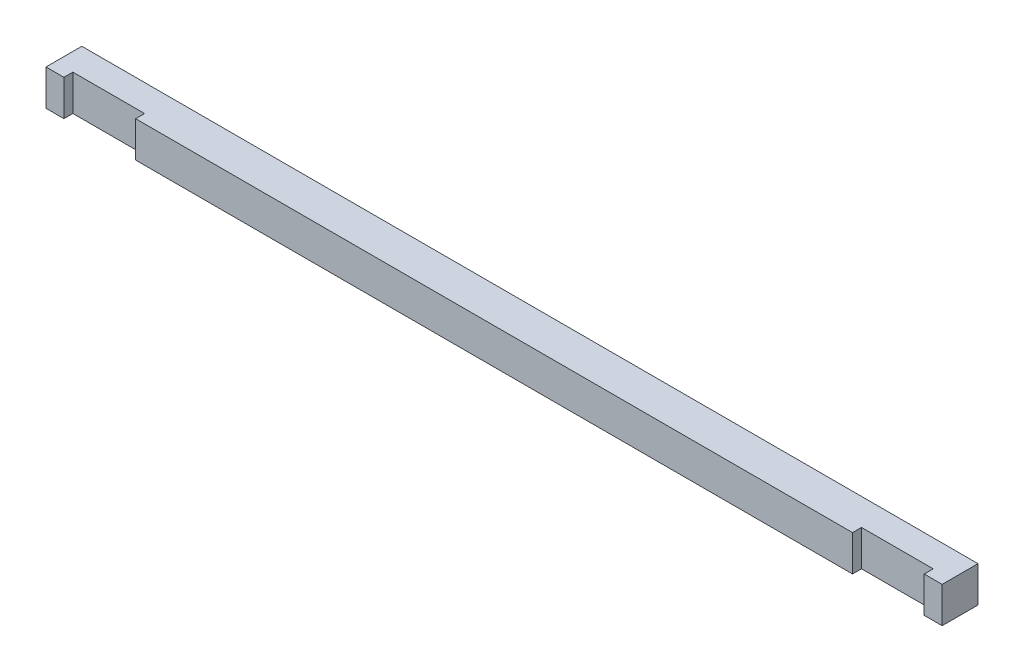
ISO-10303-21;
HEADER;
FILE_DESCRIPTION(('STEP AP214'),'2;1');
FILE_NAME('part.step','',(''),(''),'','','');
FILE_SCHEMA(('AUTOMOTIVE_DESIGN { 1 0 10303 214 1 1 1 1 }'));
ENDSEC;
DATA;
#1=APPLICATION_CONTEXT('core data for automotive mechanical design processes');
#2=APPLICATION_PROTOCOL_DEFINITION('international standard','automotive_design',2000,#1);
#3=PRODUCT_CONTEXT('',#1,'mechanical');
#4=PRODUCT('Part','Part','',(#3));
#5=PRODUCT_RELATED_PRODUCT_CATEGORY('part','',(#4));
#6=PRODUCT_DEFINITION_FORMATION('','',#4);
#7=PRODUCT_DEFINITION_CONTEXT('part definition',#1,'design');
#8=PRODUCT_DEFINITION('design','',#6,#7);
#9=PRODUCT_DEFINITION_SHAPE('','',#8);
#10=(LENGTH_UNIT() NAMED_UNIT(*) SI_UNIT(.MILLI.,.METRE.));
#11=(NAMED_UNIT(*) PLANE_ANGLE_UNIT() SI_UNIT($,.RADIAN.));
#12=(NAMED_UNIT(*) SI_UNIT($,.STERADIAN.) SOLID_ANGLE_UNIT());
#13=UNCERTAINTY_MEASURE_WITH_UNIT(LENGTH_MEASURE(1.E-05),#10,'distance_accuracy_value','');
#14=(GEOMETRIC_REPRESENTATION_CONTEXT(3) GLOBAL_UNCERTAINTY_ASSIGNED_CONTEXT((#13)) GLOBAL_UNIT_ASSIGNED_CONTEXT((#10,
#11,#12)) REPRESENTATION_CONTEXT('',''));
#15=CARTESIAN_POINT('',(0.,0.,0.));
#16=DIRECTION('',(0.,0.,1.));
#17=DIRECTION('',(1.,0.,0.));
#18=AXIS2_PLACEMENT_3D('',#15,#16,#17);
#19=CARTESIAN_POINT('',(-125.,10.,-10.));
#20=DIRECTION('',(1.,0.,0.));
#21=DIRECTION('',(0.,0.,-1.));
#22=AXIS2_PLACEMENT_3D('',#19,#20,#21);
#23=PLANE('',#22);
#24=DIRECTION('',(0.,0.,1.));
#25=VECTOR('',#24,1.);
#26=CARTESIAN_POINT('',(-125.,0.,-10.));
#27=LINE('',#26,#25);
#28=CARTESIAN_POINT('',(-125.,0.,-10.));
#29=VERTEX_POINT('',#28);
#30=CARTESIAN_POINT('',(-125.,0.,0.));
#31=VERTEX_POINT('',#30);
#32=EDGE_CURVE('E154',#29,#31,#27,.T.);
#33=ORIENTED_EDGE('',*,*,#32,.T.);
#34=DIRECTION('',(0.,-1.,0.));
#35=VECTOR('',#34,1.);
#36=CARTESIAN_POINT('',(-125.,10.,0.));
#37=LINE('',#36,#35);
#38=CARTESIAN_POINT('',(-125.,10.,0.));
#39=VERTEX_POINT('',#38);
#40=EDGE_CURVE('E11',#39,#31,#37,.T.);
#41=ORIENTED_EDGE('',*,*,#40,.F.);
#42=DIRECTION('',(0.,0.,1.));
#43=VECTOR('',#42,1.);
#44=CARTESIAN_POINT('',(-125.,10.,-10.));
#45=LINE('',#44,#43);
#46=CARTESIAN_POINT('',(-125.,10.,-10.));
#47=VERTEX_POINT('',#46);
#48=EDGE_CURVE('E176',#47,#39,#45,.T.);
#49=ORIENTED_EDGE('',*,*,#48,.F.);
#50=DIRECTION('',(0.,-1.,0.));
#51=VECTOR('',#50,1.);
#52=CARTESIAN_POINT('',(-125.,10.,-10.));
#53=LINE('',#52,#51);
#54=EDGE_CURVE('E150',#47,#29,#53,.T.);
#55=ORIENTED_EDGE('',*,*,#54,.T.);
#56=EDGE_LOOP('',(#33,#41,#49,#55));
#57=FACE_BOUND('',#56,.T.);
#58=ADVANCED_FACE('F34',(#57),#23,.F.);
#59=CARTESIAN_POINT('',(-125.,10.,0.));
#60=DIRECTION('',(0.,0.,-1.));
#61=DIRECTION('',(-1.,0.,0.));
#62=AXIS2_PLACEMENT_3D('',#59,#60,#61);
#63=PLANE('',#62);
#64=DIRECTION('',(1.,0.,0.));
#65=VECTOR('',#64,1.);
#66=CARTESIAN_POINT('',(-125.,0.,0.));
#67=LINE('',#66,#65);
#68=CARTESIAN_POINT('',(-120.,0.,0.));
#69=VERTEX_POINT('',#68);
#70=EDGE_CURVE('E157',#31,#69,#67,.T.);
#71=ORIENTED_EDGE('',*,*,#70,.T.);
#72=DIRECTION('',(0.,-1.,0.));
#73=VECTOR('',#72,1.);
#74=CARTESIAN_POINT('',(-120.,10.,0.));
#75=LINE('',#74,#73);
#76=CARTESIAN_POINT('',(-120.,10.,0.));
#77=VERTEX_POINT('',#76);
#78=EDGE_CURVE('E42',#77,#69,#75,.T.);
#79=ORIENTED_EDGE('',*,*,#78,.F.);
#80=DIRECTION('',(1.,0.,0.));
#81=VECTOR('',#80,1.);
#82=CARTESIAN_POINT('',(-125.,10.,0.));
#83=LINE('',#82,#81);
#84=EDGE_CURVE('E105',#39,#77,#83,.T.);
#85=ORIENTED_EDGE('',*,*,#84,.F.);
#86=ORIENTED_EDGE('',*,*,#40,.T.);
#87=EDGE_LOOP('',(#71,#79,#85,#86));
#88=FACE_BOUND('',#87,.T.);
#89=ADVANCED_FACE('F254',(#88),#63,.F.);
#90=CARTESIAN_POINT('',(-120.,10.,0.));
#91=DIRECTION('',(-1.,0.,0.));
#92=DIRECTION('',(0.,0.,1.));
#93=AXIS2_PLACEMENT_3D('',#90,#91,#92);
#94=PLANE('',#93);
#95=DIRECTION('',(0.,0.,-1.));
#96=VECTOR('',#95,1.);
#97=CARTESIAN_POINT('',(-120.,0.,0.));
#98=LINE('',#97,#96);
#99=CARTESIAN_POINT('',(-120.,0.,-2.5));
#100=VERTEX_POINT('',#99);
#101=EDGE_CURVE('E159',#69,#100,#98,.T.);
#102=ORIENTED_EDGE('',*,*,#101,.T.);
#103=DIRECTION('',(0.,-1.,0.));
#104=VECTOR('',#103,1.);
#105=CARTESIAN_POINT('',(-120.,10.,-2.5));
#106=LINE('',#105,#104);
#107=CARTESIAN_POINT('',(-120.,10.,-2.5));
#108=VERTEX_POINT('',#107);
#109=EDGE_CURVE('E195',#108,#100,#106,.T.);
#110=ORIENTED_EDGE('',*,*,#109,.F.);
#111=DIRECTION('',(0.,0.,-1.));
#112=VECTOR('',#111,1.);
#113=CARTESIAN_POINT('',(-120.,10.,0.));
#114=LINE('',#113,#112);
#115=EDGE_CURVE('E203',#77,#108,#114,.T.);
#116=ORIENTED_EDGE('',*,*,#115,.F.);
#117=ORIENTED_EDGE('',*,*,#78,.T.);
#118=EDGE_LOOP('',(#102,#110,#116,#117));
#119=FACE_BOUND('',#118,.T.);
#120=ADVANCED_FACE('F201',(#119),#94,.F.);
#121=CARTESIAN_POINT('',(-120.,10.,-2.5));
#122=DIRECTION('',(0.,0.,-1.));
#123=DIRECTION('',(-1.,0.,0.));
#124=AXIS2_PLACEMENT_3D('',#121,#122,#123);
#125=PLANE('',#124);
#126=DIRECTION('',(1.,0.,0.));
#127=VECTOR('',#126,1.);
#128=CARTESIAN_POINT('',(-120.,0.,-2.5));
#129=LINE('',#128,#127);
#130=CARTESIAN_POINT('',(-100.,0.,-2.5));
#131=VERTEX_POINT('',#130);
#132=EDGE_CURVE('E161',#100,#131,#129,.T.);
#133=ORIENTED_EDGE('',*,*,#132,.T.);
#134=DIRECTION('',(0.,-1.,0.));
#135=VECTOR('',#134,1.);
#136=CARTESIAN_POINT('',(-100.,10.,-2.5));
#137=LINE('',#136,#135);
#138=CARTESIAN_POINT('',(-100.,10.,-2.5));
#139=VERTEX_POINT('',#138);
#140=EDGE_CURVE('E192',#139,#131,#137,.T.);
#141=ORIENTED_EDGE('',*,*,#140,.F.);
#142=DIRECTION('',(1.,0.,0.));
#143=VECTOR('',#142,1.);
#144=CARTESIAN_POINT('',(-120.,10.,-2.5));
#145=LINE('',#144,#143);
#146=EDGE_CURVE('E221',#108,#139,#145,.T.);
#147=ORIENTED_EDGE('',*,*,#146,.F.);
#148=ORIENTED_EDGE('',*,*,#109,.T.);
#149=EDGE_LOOP('',(#133,#141,#147,#148));
#150=FACE_BOUND('',#149,.T.);
#151=ADVANCED_FACE('F212',(#150),#125,.F.);
#152=CARTESIAN_POINT('',(-100.,10.,-2.5));
#153=DIRECTION('',(1.,0.,0.));
#154=DIRECTION('',(0.,0.,-1.));
#155=AXIS2_PLACEMENT_3D('',#152,#153,#154);
#156=PLANE('',#155);
#157=DIRECTION('',(0.,0.,1.));
#158=VECTOR('',#157,1.);
#159=CARTESIAN_POINT('',(-100.,0.,-2.5));
#160=LINE('',#159,#158);
#161=CARTESIAN_POINT('',(-100.,0.,0.));
#162=VERTEX_POINT('',#161);
#163=EDGE_CURVE('E163',#131,#162,#160,.T.);
#164=ORIENTED_EDGE('',*,*,#163,.T.);
#165=DIRECTION('',(0.,-1.,0.));
#166=VECTOR('',#165,1.);
#167=CARTESIAN_POINT('',(-100.,10.,0.));
#168=LINE('',#167,#166);
#169=CARTESIAN_POINT('',(-100.,10.,0.));
#170=VERTEX_POINT('',#169);
#171=EDGE_CURVE('E189',#170,#162,#168,.T.);
#172=ORIENTED_EDGE('',*,*,#171,.F.);
#173=DIRECTION('',(0.,0.,1.));
#174=VECTOR('',#173,1.);
#175=CARTESIAN_POINT('',(-100.,10.,-2.5));
#176=LINE('',#175,#174);
#177=EDGE_CURVE('E218',#139,#170,#176,.T.);
#178=ORIENTED_EDGE('',*,*,#177,.F.);
#179=ORIENTED_EDGE('',*,*,#140,.T.);
#180=EDGE_LOOP('',(#164,#172,#178,#179));
#181=FACE_BOUND('',#180,.T.);
#182=ADVANCED_FACE('F216',(#181),#156,.F.);
#183=CARTESIAN_POINT('',(-100.,10.,0.));
#184=DIRECTION('',(0.,0.,-1.));
#185=DIRECTION('',(-1.,0.,0.));
#186=AXIS2_PLACEMENT_3D('',#183,#184,#185);
#187=PLANE('',#186);
#188=DIRECTION('',(1.,0.,0.));
#189=VECTOR('',#188,1.);
#190=CARTESIAN_POINT('',(-100.,0.,0.));
#191=LINE('',#190,#189);
#192=CARTESIAN_POINT('',(100.,0.,0.));
#193=VERTEX_POINT('',#192);
#194=EDGE_CURVE('E165',#162,#193,#191,.T.);
#195=ORIENTED_EDGE('',*,*,#194,.T.);
#196=DIRECTION('',(0.,-1.,0.));
#197=VECTOR('',#196,1.);
#198=CARTESIAN_POINT('',(100.,10.,0.));
#199=LINE('',#198,#197);
#200=CARTESIAN_POINT('',(100.,10.,0.));
#201=VERTEX_POINT('',#200);
#202=EDGE_CURVE('E186',#201,#193,#199,.T.);
#203=ORIENTED_EDGE('',*,*,#202,.F.);
#204=DIRECTION('',(1.,0.,0.));
#205=VECTOR('',#204,1.);
#206=CARTESIAN_POINT('',(-100.,10.,0.));
#207=LINE('',#206,#205);
#208=EDGE_CURVE('E220',#170,#201,#207,.T.);
#209=ORIENTED_EDGE('',*,*,#208,.F.);
#210=ORIENTED_EDGE('',*,*,#171,.T.);
#211=EDGE_LOOP('',(#195,#203,#209,#210));
#212=FACE_BOUND('',#211,.T.);
#213=ADVANCED_FACE('F267',(#212),#187,.F.);
#214=CARTESIAN_POINT('',(100.,10.,-2.5));
#215=DIRECTION('',(-1.,0.,0.));
#216=DIRECTION('',(0.,0.,1.));
#217=AXIS2_PLACEMENT_3D('',#214,#215,#216);
#218=PLANE('',#217);
#219=DIRECTION('',(0.,0.,-1.));
#220=VECTOR('',#219,1.);
#221=CARTESIAN_POINT('',(100.,0.,-2.5));
#222=LINE('',#221,#220);
#223=CARTESIAN_POINT('',(100.,0.,-2.5));
#224=VERTEX_POINT('',#223);
#225=EDGE_CURVE('E167',#193,#224,#222,.T.);
#226=ORIENTED_EDGE('',*,*,#225,.T.);
#227=DIRECTION('',(0.,-1.,0.));
#228=VECTOR('',#227,1.);
#229=CARTESIAN_POINT('',(100.,10.,-2.5));
#230=LINE('',#229,#228);
#231=CARTESIAN_POINT('',(100.,10.,-2.5));
#232=VERTEX_POINT('',#231);
#233=EDGE_CURVE('E183',#232,#224,#230,.T.);
#234=ORIENTED_EDGE('',*,*,#233,.F.);
#235=DIRECTION('',(0.,0.,-1.));
#236=VECTOR('',#235,1.);
#237=CARTESIAN_POINT('',(100.,10.,-2.5));
#238=LINE('',#237,#236);
#239=EDGE_CURVE('E223',#201,#232,#238,.T.);
#240=ORIENTED_EDGE('',*,*,#239,.F.);
#241=ORIENTED_EDGE('',*,*,#202,.T.);
#242=EDGE_LOOP('',(#226,#234,#240,#241));
#243=FACE_BOUND('',#242,.T.);
#244=ADVANCED_FACE('F270',(#243),#218,.F.);
#245=CARTESIAN_POINT('',(120.,10.,-2.5));
#246=DIRECTION('',(0.,0.,-1.));
#247=DIRECTION('',(-1.,0.,0.));
#248=AXIS2_PLACEMENT_3D('',#245,#246,#247);
#249=PLANE('',#248);
#250=DIRECTION('',(1.,0.,0.));
#251=VECTOR('',#250,1.);
#252=CARTESIAN_POINT('',(120.,0.,-2.5));
#253=LINE('',#252,#251);
#254=CARTESIAN_POINT('',(120.,0.,-2.5));
#255=VERTEX_POINT('',#254);
#256=EDGE_CURVE('E169',#224,#255,#253,.T.);
#257=ORIENTED_EDGE('',*,*,#256,.T.);
#258=DIRECTION('',(0.,-1.,0.));
#259=VECTOR('',#258,1.);
#260=CARTESIAN_POINT('',(120.,10.,-2.5));
#261=LINE('',#260,#259);
#262=CARTESIAN_POINT('',(120.,10.,-2.5));
#263=VERTEX_POINT('',#262);
#264=EDGE_CURVE('E180',#263,#255,#261,.T.);
#265=ORIENTED_EDGE('',*,*,#264,.F.);
#266=DIRECTION('',(1.,0.,0.));
#267=VECTOR('',#266,1.);
#268=CARTESIAN_POINT('',(120.,10.,-2.5));
#269=LINE('',#268,#267);
#270=EDGE_CURVE('E229',#232,#263,#269,.T.);
#271=ORIENTED_EDGE('',*,*,#270,.F.);
#272=ORIENTED_EDGE('',*,*,#233,.T.);
#273=EDGE_LOOP('',(#257,#265,#271,#272));
#274=FACE_BOUND('',#273,.T.);
#275=ADVANCED_FACE('F235',(#274),#249,.F.);
#276=CARTESIAN_POINT('',(120.,10.,0.));
#277=DIRECTION('',(1.,0.,0.));
#278=DIRECTION('',(0.,0.,-1.));
#279=AXIS2_PLACEMENT_3D('',#276,#277,#278);
#280=PLANE('',#279);
#281=DIRECTION('',(0.,0.,1.));
#282=VECTOR('',#281,1.);
#283=CARTESIAN_POINT('',(120.,0.,0.));
#284=LINE('',#283,#282);
#285=CARTESIAN_POINT('',(120.,0.,0.));
#286=VERTEX_POINT('',#285);
#287=EDGE_CURVE('E171',#255,#286,#284,.T.);
#288=ORIENTED_EDGE('',*,*,#287,.T.);
#289=DIRECTION('',(0.,-1.,0.));
#290=VECTOR('',#289,1.);
#291=CARTESIAN_POINT('',(120.,10.,0.));
#292=LINE('',#291,#290);
#293=CARTESIAN_POINT('',(120.,10.,0.));
#294=VERTEX_POINT('',#293);
#295=EDGE_CURVE('E145',#294,#286,#292,.T.);
#296=ORIENTED_EDGE('',*,*,#295,.F.);
#297=DIRECTION('',(0.,0.,1.));
#298=VECTOR('',#297,1.);
#299=CARTESIAN_POINT('',(120.,10.,0.));
#300=LINE('',#299,#298);
#301=EDGE_CURVE('E136',#263,#294,#300,.T.);
#302=ORIENTED_EDGE('',*,*,#301,.F.);
#303=ORIENTED_EDGE('',*,*,#264,.T.);
#304=EDGE_LOOP('',(#288,#296,#302,#303));
#305=FACE_BOUND('',#304,.T.);
#306=ADVANCED_FACE('F239',(#305),#280,.F.);
#307=CARTESIAN_POINT('',(120.,10.,0.));
#308=DIRECTION('',(0.,0.,-1.));
#309=DIRECTION('',(-1.,0.,0.));
#310=AXIS2_PLACEMENT_3D('',#307,#308,#309);
#311=PLANE('',#310);
#312=DIRECTION('',(1.,0.,0.));
#313=VECTOR('',#312,1.);
#314=CARTESIAN_POINT('',(120.,0.,0.));
#315=LINE('',#314,#313);
#316=CARTESIAN_POINT('',(125.,0.,0.));
#317=VERTEX_POINT('',#316);
#318=EDGE_CURVE('E144',#286,#317,#315,.T.);
#319=ORIENTED_EDGE('',*,*,#318,.T.);
#320=DIRECTION('',(0.,-1.,0.));
#321=VECTOR('',#320,1.);
#322=CARTESIAN_POINT('',(125.,10.,0.));
#323=LINE('',#322,#321);
#324=CARTESIAN_POINT('',(125.,10.,0.));
#325=VERTEX_POINT('',#324);
#326=EDGE_CURVE('E141',#325,#317,#323,.T.);
#327=ORIENTED_EDGE('',*,*,#326,.F.);
#328=DIRECTION('',(1.,0.,0.));
#329=VECTOR('',#328,1.);
#330=CARTESIAN_POINT('',(120.,10.,0.));
#331=LINE('',#330,#329);
#332=EDGE_CURVE('E130',#294,#325,#331,.T.);
#333=ORIENTED_EDGE('',*,*,#332,.F.);
#334=ORIENTED_EDGE('',*,*,#295,.T.);
#335=EDGE_LOOP('',(#319,#327,#333,#334));
#336=FACE_BOUND('',#335,.T.);
#337=ADVANCED_FACE('F142',(#336),#311,.F.);
#338=CARTESIAN_POINT('',(125.,10.,-10.));
#339=DIRECTION('',(-1.,0.,0.));
#340=DIRECTION('',(0.,0.,1.));
#341=AXIS2_PLACEMENT_3D('',#338,#339,#340);
#342=PLANE('',#341);
#343=DIRECTION('',(0.,0.,-1.));
#344=VECTOR('',#343,1.);
#345=CARTESIAN_POINT('',(125.,0.,-10.));
#346=LINE('',#345,#344);
#347=CARTESIAN_POINT('',(125.,0.,-10.));
#348=VERTEX_POINT('',#347);
#349=EDGE_CURVE('E91',#317,#348,#346,.T.);
#350=ORIENTED_EDGE('',*,*,#349,.T.);
#351=DIRECTION('',(0.,-1.,0.));
#352=VECTOR('',#351,1.);
#353=CARTESIAN_POINT('',(125.,10.,-10.));
#354=LINE('',#353,#352);
#355=CARTESIAN_POINT('',(125.,10.,-10.));
#356=VERTEX_POINT('',#355);
#357=EDGE_CURVE('E146',#356,#348,#354,.T.);
#358=ORIENTED_EDGE('',*,*,#357,.F.);
#359=DIRECTION('',(0.,0.,-1.));
#360=VECTOR('',#359,1.);
#361=CARTESIAN_POINT('',(125.,10.,-10.));
#362=LINE('',#361,#360);
#363=EDGE_CURVE('E134',#325,#356,#362,.T.);
#364=ORIENTED_EDGE('',*,*,#363,.F.);
#365=ORIENTED_EDGE('',*,*,#326,.T.);
#366=EDGE_LOOP('',(#350,#358,#364,#365));
#367=FACE_BOUND('',#366,.T.);
#368=ADVANCED_FACE('F148',(#367),#342,.F.);
#369=CARTESIAN_POINT('',(-125.,10.,-10.));
#370=DIRECTION('',(0.,0.,1.));
#371=DIRECTION('',(1.,0.,0.));
#372=AXIS2_PLACEMENT_3D('',#369,#370,#371);
#373=PLANE('',#372);
#374=DIRECTION('',(-1.,0.,0.));
#375=VECTOR('',#374,1.);
#376=CARTESIAN_POINT('',(-125.,0.,-10.));
#377=LINE('',#376,#375);
#378=EDGE_CURVE('E97',#348,#29,#377,.T.);
#379=ORIENTED_EDGE('',*,*,#378,.T.);
#380=ORIENTED_EDGE('',*,*,#54,.F.);
#381=DIRECTION('',(-1.,0.,0.));
#382=VECTOR('',#381,1.);
#383=CARTESIAN_POINT('',(-125.,10.,-10.));
#384=LINE('',#383,#382);
#385=EDGE_CURVE('E50',#356,#47,#384,.T.);
#386=ORIENTED_EDGE('',*,*,#385,.F.);
#387=ORIENTED_EDGE('',*,*,#357,.T.);
#388=EDGE_LOOP('',(#379,#380,#386,#387));
#389=FACE_BOUND('',#388,.T.);
#390=ADVANCED_FACE('F243',(#389),#373,.F.);
#391=CARTESIAN_POINT('',(0.,10.,0.));
#392=DIRECTION('',(0.,1.,0.));
#393=DIRECTION('',(0.,0.,1.));
#394=AXIS2_PLACEMENT_3D('',#391,#392,#393);
#395=PLANE('',#394);
#396=ORIENTED_EDGE('',*,*,#48,.T.);
#397=ORIENTED_EDGE('',*,*,#84,.T.);
#398=ORIENTED_EDGE('',*,*,#115,.T.);
#399=ORIENTED_EDGE('',*,*,#146,.T.);
#400=ORIENTED_EDGE('',*,*,#177,.T.);
#401=ORIENTED_EDGE('',*,*,#208,.T.);
#402=ORIENTED_EDGE('',*,*,#239,.T.);
#403=ORIENTED_EDGE('',*,*,#270,.T.);
#404=ORIENTED_EDGE('',*,*,#301,.T.);
#405=ORIENTED_EDGE('',*,*,#332,.T.);
#406=ORIENTED_EDGE('',*,*,#363,.T.);
#407=ORIENTED_EDGE('',*,*,#385,.T.);
#408=EDGE_LOOP('',(#396,#397,#398,#399,#400,#401,#402,#403,#404,#405,#406,#407));
#409=FACE_BOUND('',#408,.T.);
#410=ADVANCED_FACE('F132',(#409),#395,.T.);
#411=CARTESIAN_POINT('',(0.,0.,0.));
#412=DIRECTION('',(0.,1.,0.));
#413=DIRECTION('',(0.,0.,1.));
#414=AXIS2_PLACEMENT_3D('',#411,#412,#413);
#415=PLANE('',#414);
#416=ORIENTED_EDGE('',*,*,#32,.F.);
#417=ORIENTED_EDGE('',*,*,#378,.F.);
#418=ORIENTED_EDGE('',*,*,#349,.F.);
#419=ORIENTED_EDGE('',*,*,#318,.F.);
#420=ORIENTED_EDGE('',*,*,#287,.F.);
#421=ORIENTED_EDGE('',*,*,#256,.F.);
#422=ORIENTED_EDGE('',*,*,#225,.F.);
#423=ORIENTED_EDGE('',*,*,#194,.F.);
#424=ORIENTED_EDGE('',*,*,#163,.F.);
#425=ORIENTED_EDGE('',*,*,#132,.F.);
#426=ORIENTED_EDGE('',*,*,#101,.F.);
#427=ORIENTED_EDGE('',*,*,#70,.F.);
#428=EDGE_LOOP('',(#416,#417,#418,#419,#420,#421,#422,#423,#424,#425,#426,#427));
#429=FACE_BOUND('',#428,.T.);
#430=ADVANCED_FACE('F207',(#429),#415,.F.);
#431=CLOSED_SHELL('',(#58,#89,#120,#151,#182,#213,#244,#275,#306,#337,#368,#390,#410,#430));
#432=MANIFOLD_SOLID_BREP('B2',#431);
#433=ADVANCED_BREP_SHAPE_REPRESENTATION('',(#18,#432),#14);
#434=SHAPE_DEFINITION_REPRESENTATION(#9,#433);
ENDSEC;
END-ISO-10303-21;
